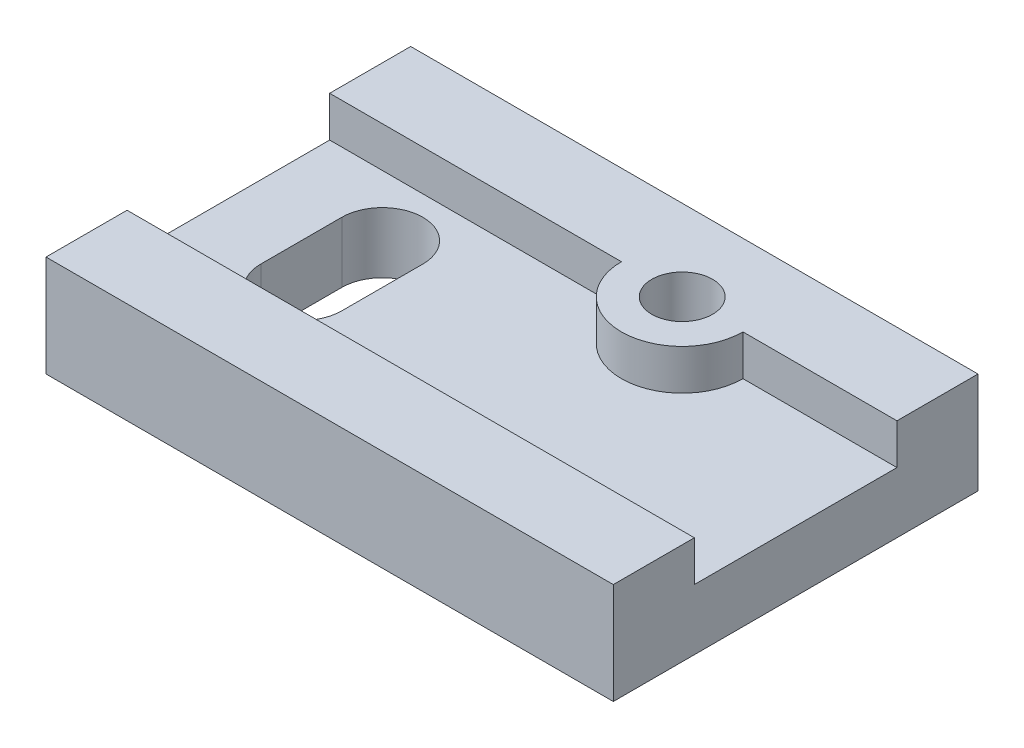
ISO-10303-21;
HEADER;
FILE_DESCRIPTION(('STEP AP214'),'2;1');
FILE_NAME('part.step','',(''),(''),'','','');
FILE_SCHEMA(('AUTOMOTIVE_DESIGN { 1 0 10303 214 1 1 1 1 }'));
ENDSEC;
DATA;
#1=APPLICATION_CONTEXT('core data for automotive mechanical design processes');
#2=APPLICATION_PROTOCOL_DEFINITION('international standard','automotive_design',2000,#1);
#3=PRODUCT_CONTEXT('',#1,'mechanical');
#4=PRODUCT('Part','Part','',(#3));
#5=PRODUCT_RELATED_PRODUCT_CATEGORY('part','',(#4));
#6=PRODUCT_DEFINITION_FORMATION('','',#4);
#7=PRODUCT_DEFINITION_CONTEXT('part definition',#1,'design');
#8=PRODUCT_DEFINITION('design','',#6,#7);
#9=PRODUCT_DEFINITION_SHAPE('','',#8);
#10=(LENGTH_UNIT() NAMED_UNIT(*) SI_UNIT(.MILLI.,.METRE.));
#11=(NAMED_UNIT(*) PLANE_ANGLE_UNIT() SI_UNIT($,.RADIAN.));
#12=(NAMED_UNIT(*) SI_UNIT($,.STERADIAN.) SOLID_ANGLE_UNIT());
#13=UNCERTAINTY_MEASURE_WITH_UNIT(LENGTH_MEASURE(1.E-05),#10,'distance_accuracy_value','');
#14=(GEOMETRIC_REPRESENTATION_CONTEXT(3) GLOBAL_UNCERTAINTY_ASSIGNED_CONTEXT((#13)) GLOBAL_UNIT_ASSIGNED_CONTEXT((#10,
#11,#12)) REPRESENTATION_CONTEXT('',''));
#15=CARTESIAN_POINT('',(0.,0.,0.));
#16=DIRECTION('',(0.,0.,1.));
#17=DIRECTION('',(1.,0.,0.));
#18=AXIS2_PLACEMENT_3D('',#15,#16,#17);
#19=CARTESIAN_POINT('',(0.,25.,0.));
#20=DIRECTION('',(0.,-1.,0.));
#21=DIRECTION('',(0.,0.,-1.));
#22=AXIS2_PLACEMENT_3D('',#19,#20,#21);
#23=PLANE('',#22);
#24=CARTESIAN_POINT('',(-53.,25.,20.));
#25=DIRECTION('',(0.,1.,0.));
#26=DIRECTION('',(0.,0.,1.));
#27=AXIS2_PLACEMENT_3D('',#24,#25,#26);
#28=CIRCLE('',#27,7.5);
#29=CARTESIAN_POINT('',(-53.,25.,27.5));
#30=VERTEX_POINT('',#29);
#31=EDGE_CURVE('E165',#30,#30,#28,.T.);
#32=ORIENTED_EDGE('',*,*,#31,.F.);
#33=EDGE_LOOP('',(#32));
#34=FACE_BOUND('',#33,.T.);
#35=DIRECTION('',(0.,0.,1.));
#36=VECTOR('',#35,1.);
#37=CARTESIAN_POINT('',(-140.,25.,0.));
#38=LINE('',#37,#36);
#39=CARTESIAN_POINT('',(-140.,25.,0.));
#40=VERTEX_POINT('',#39);
#41=CARTESIAN_POINT('',(-140.,25.,20.));
#42=VERTEX_POINT('',#41);
#43=EDGE_CURVE('E224',#40,#42,#38,.T.);
#44=ORIENTED_EDGE('',*,*,#43,.T.);
#45=DIRECTION('',(-1.,0.,0.));
#46=VECTOR('',#45,1.);
#47=CARTESIAN_POINT('',(-140.,25.,20.));
#48=LINE('',#47,#46);
#49=CARTESIAN_POINT('',(-68.,25.,20.));
#50=VERTEX_POINT('',#49);
#51=EDGE_CURVE('E179',#50,#42,#48,.T.);
#52=ORIENTED_EDGE('',*,*,#51,.F.);
#53=CARTESIAN_POINT('',(-53.,25.,20.));
#54=DIRECTION('',(0.,-1.,0.));
#55=DIRECTION('',(0.,0.,1.));
#56=AXIS2_PLACEMENT_3D('',#53,#54,#55);
#57=CIRCLE('',#56,15.);
#58=CARTESIAN_POINT('',(-38.,25.,20.));
#59=VERTEX_POINT('',#58);
#60=EDGE_CURVE('E199',#59,#50,#57,.T.);
#61=ORIENTED_EDGE('',*,*,#60,.F.);
#62=DIRECTION('',(-1.,0.,0.));
#63=VECTOR('',#62,1.);
#64=CARTESIAN_POINT('',(-38.,25.,20.));
#65=LINE('',#64,#63);
#66=CARTESIAN_POINT('',(0.,25.,20.));
#67=VERTEX_POINT('',#66);
#68=EDGE_CURVE('E196',#67,#59,#65,.T.);
#69=ORIENTED_EDGE('',*,*,#68,.F.);
#70=DIRECTION('',(0.,0.,-1.));
#71=VECTOR('',#70,1.);
#72=CARTESIAN_POINT('',(0.,25.,0.));
#73=LINE('',#72,#71);
#74=CARTESIAN_POINT('',(0.,25.,0.));
#75=VERTEX_POINT('',#74);
#76=EDGE_CURVE('E221',#67,#75,#73,.T.);
#77=ORIENTED_EDGE('',*,*,#76,.T.);
#78=DIRECTION('',(-1.,0.,0.));
#79=VECTOR('',#78,1.);
#80=CARTESIAN_POINT('',(0.,25.,0.));
#81=LINE('',#80,#79);
#82=EDGE_CURVE('E220',#75,#40,#81,.T.);
#83=ORIENTED_EDGE('',*,*,#82,.T.);
#84=EDGE_LOOP('',(#44,#52,#61,#69,#77,#83));
#85=FACE_BOUND('',#84,.T.);
#86=ADVANCED_FACE('F31',(#34,#85),#23,.F.);
#87=CARTESIAN_POINT('',(0.,25.,0.));
#88=DIRECTION('',(-1.,0.,0.));
#89=DIRECTION('',(0.,0.,1.));
#90=AXIS2_PLACEMENT_3D('',#87,#88,#89);
#91=PLANE('',#90);
#92=ORIENTED_EDGE('',*,*,#76,.F.);
#93=DIRECTION('',(0.,1.,0.));
#94=VECTOR('',#93,1.);
#95=CARTESIAN_POINT('',(0.,15.,20.));
#96=LINE('',#95,#94);
#97=CARTESIAN_POINT('',(0.,15.,20.));
#98=VERTEX_POINT('',#97);
#99=EDGE_CURVE('E211',#98,#67,#96,.T.);
#100=ORIENTED_EDGE('',*,*,#99,.F.);
#101=DIRECTION('',(0.,0.,-1.));
#102=VECTOR('',#101,1.);
#103=CARTESIAN_POINT('',(0.,15.,20.));
#104=LINE('',#103,#102);
#105=CARTESIAN_POINT('',(0.,15.,70.));
#106=VERTEX_POINT('',#105);
#107=EDGE_CURVE('E182',#106,#98,#104,.T.);
#108=ORIENTED_EDGE('',*,*,#107,.F.);
#109=DIRECTION('',(0.,1.,0.));
#110=VECTOR('',#109,1.);
#111=CARTESIAN_POINT('',(0.,15.,70.));
#112=LINE('',#111,#110);
#113=CARTESIAN_POINT('',(0.,25.,70.));
#114=VERTEX_POINT('',#113);
#115=EDGE_CURVE('E213',#106,#114,#112,.T.);
#116=ORIENTED_EDGE('',*,*,#115,.T.);
#117=CARTESIAN_POINT('',(0.,25.,90.));
#118=VERTEX_POINT('',#117);
#119=EDGE_CURVE('E217',#118,#114,#73,.T.);
#120=ORIENTED_EDGE('',*,*,#119,.F.);
#121=DIRECTION('',(0.,-1.,0.));
#122=VECTOR('',#121,1.);
#123=CARTESIAN_POINT('',(0.,25.,90.));
#124=LINE('',#123,#122);
#125=CARTESIAN_POINT('',(0.,0.,90.));
#126=VERTEX_POINT('',#125);
#127=EDGE_CURVE('E229',#118,#126,#124,.T.);
#128=ORIENTED_EDGE('',*,*,#127,.T.);
#129=DIRECTION('',(0.,0.,-1.));
#130=VECTOR('',#129,1.);
#131=CARTESIAN_POINT('',(0.,0.,0.));
#132=LINE('',#131,#130);
#133=CARTESIAN_POINT('',(0.,0.,0.));
#134=VERTEX_POINT('',#133);
#135=EDGE_CURVE('E206',#126,#134,#132,.T.);
#136=ORIENTED_EDGE('',*,*,#135,.T.);
#137=DIRECTION('',(0.,-1.,0.));
#138=VECTOR('',#137,1.);
#139=CARTESIAN_POINT('',(0.,25.,0.));
#140=LINE('',#139,#138);
#141=EDGE_CURVE('E11',#75,#134,#140,.T.);
#142=ORIENTED_EDGE('',*,*,#141,.F.);
#143=EDGE_LOOP('',(#92,#100,#108,#116,#120,#128,#136,#142));
#144=FACE_BOUND('',#143,.T.);
#145=ADVANCED_FACE('F33',(#144),#91,.F.);
#146=CARTESIAN_POINT('',(0.,25.,0.));
#147=DIRECTION('',(0.,0.,1.));
#148=DIRECTION('',(1.,0.,0.));
#149=AXIS2_PLACEMENT_3D('',#146,#147,#148);
#150=PLANE('',#149);
#151=DIRECTION('',(-1.,0.,0.));
#152=VECTOR('',#151,1.);
#153=CARTESIAN_POINT('',(0.,0.,0.));
#154=LINE('',#153,#152);
#155=CARTESIAN_POINT('',(-140.,0.,0.));
#156=VERTEX_POINT('',#155);
#157=EDGE_CURVE('E232',#134,#156,#154,.T.);
#158=ORIENTED_EDGE('',*,*,#157,.T.);
#159=DIRECTION('',(0.,-1.,0.));
#160=VECTOR('',#159,1.);
#161=CARTESIAN_POINT('',(-140.,25.,0.));
#162=LINE('',#161,#160);
#163=EDGE_CURVE('E39',#40,#156,#162,.T.);
#164=ORIENTED_EDGE('',*,*,#163,.F.);
#165=ORIENTED_EDGE('',*,*,#82,.F.);
#166=ORIENTED_EDGE('',*,*,#141,.T.);
#167=EDGE_LOOP('',(#158,#164,#165,#166));
#168=FACE_BOUND('',#167,.T.);
#169=ADVANCED_FACE('F281',(#168),#150,.F.);
#170=CARTESIAN_POINT('',(-140.,25.,0.));
#171=DIRECTION('',(1.,0.,0.));
#172=DIRECTION('',(0.,0.,-1.));
#173=AXIS2_PLACEMENT_3D('',#170,#171,#172);
#174=PLANE('',#173);
#175=DIRECTION('',(0.,0.,1.));
#176=VECTOR('',#175,1.);
#177=CARTESIAN_POINT('',(-140.,15.,70.));
#178=LINE('',#177,#176);
#179=CARTESIAN_POINT('',(-140.,15.,20.));
#180=VERTEX_POINT('',#179);
#181=CARTESIAN_POINT('',(-140.,15.,70.));
#182=VERTEX_POINT('',#181);
#183=EDGE_CURVE('E175',#180,#182,#178,.T.);
#184=ORIENTED_EDGE('',*,*,#183,.F.);
#185=DIRECTION('',(0.,1.,0.));
#186=VECTOR('',#185,1.);
#187=CARTESIAN_POINT('',(-140.,15.,20.));
#188=LINE('',#187,#186);
#189=EDGE_CURVE('E203',#180,#42,#188,.T.);
#190=ORIENTED_EDGE('',*,*,#189,.T.);
#191=ORIENTED_EDGE('',*,*,#43,.F.);
#192=ORIENTED_EDGE('',*,*,#163,.T.);
#193=DIRECTION('',(0.,0.,1.));
#194=VECTOR('',#193,1.);
#195=CARTESIAN_POINT('',(-140.,0.,0.));
#196=LINE('',#195,#194);
#197=CARTESIAN_POINT('',(-140.,0.,90.));
#198=VERTEX_POINT('',#197);
#199=EDGE_CURVE('E234',#156,#198,#196,.T.);
#200=ORIENTED_EDGE('',*,*,#199,.T.);
#201=DIRECTION('',(0.,-1.,0.));
#202=VECTOR('',#201,1.);
#203=CARTESIAN_POINT('',(-140.,25.,90.));
#204=LINE('',#203,#202);
#205=CARTESIAN_POINT('',(-140.,25.,90.));
#206=VERTEX_POINT('',#205);
#207=EDGE_CURVE('E240',#206,#198,#204,.T.);
#208=ORIENTED_EDGE('',*,*,#207,.F.);
#209=CARTESIAN_POINT('',(-140.,25.,70.));
#210=VERTEX_POINT('',#209);
#211=EDGE_CURVE('E223',#210,#206,#38,.T.);
#212=ORIENTED_EDGE('',*,*,#211,.F.);
#213=DIRECTION('',(0.,1.,0.));
#214=VECTOR('',#213,1.);
#215=CARTESIAN_POINT('',(-140.,15.,70.));
#216=LINE('',#215,#214);
#217=EDGE_CURVE('E194',#182,#210,#216,.T.);
#218=ORIENTED_EDGE('',*,*,#217,.F.);
#219=EDGE_LOOP('',(#184,#190,#191,#192,#200,#208,#212,#218));
#220=FACE_BOUND('',#219,.T.);
#221=ADVANCED_FACE('F248',(#220),#174,.F.);
#222=CARTESIAN_POINT('',(0.,25.,90.));
#223=DIRECTION('',(0.,0.,-1.));
#224=DIRECTION('',(-1.,0.,0.));
#225=AXIS2_PLACEMENT_3D('',#222,#223,#224);
#226=PLANE('',#225);
#227=DIRECTION('',(1.,0.,0.));
#228=VECTOR('',#227,1.);
#229=CARTESIAN_POINT('',(0.,0.,90.));
#230=LINE('',#229,#228);
#231=EDGE_CURVE('E236',#198,#126,#230,.T.);
#232=ORIENTED_EDGE('',*,*,#231,.T.);
#233=ORIENTED_EDGE('',*,*,#127,.F.);
#234=DIRECTION('',(1.,0.,0.));
#235=VECTOR('',#234,1.);
#236=CARTESIAN_POINT('',(0.,25.,90.));
#237=LINE('',#236,#235);
#238=EDGE_CURVE('E227',#206,#118,#237,.T.);
#239=ORIENTED_EDGE('',*,*,#238,.F.);
#240=ORIENTED_EDGE('',*,*,#207,.T.);
#241=EDGE_LOOP('',(#232,#233,#239,#240));
#242=FACE_BOUND('',#241,.T.);
#243=ADVANCED_FACE('F257',(#242),#226,.F.);
#244=ORIENTED_EDGE('',*,*,#119,.T.);
#245=DIRECTION('',(1.,0.,0.));
#246=VECTOR('',#245,1.);
#247=CARTESIAN_POINT('',(0.,25.,70.));
#248=LINE('',#247,#246);
#249=EDGE_CURVE('E172',#210,#114,#248,.T.);
#250=ORIENTED_EDGE('',*,*,#249,.F.);
#251=ORIENTED_EDGE('',*,*,#211,.T.);
#252=ORIENTED_EDGE('',*,*,#238,.T.);
#253=EDGE_LOOP('',(#244,#250,#251,#252));
#254=FACE_BOUND('',#253,.T.);
#255=ADVANCED_FACE('F266',(#254),#23,.F.);
#256=CARTESIAN_POINT('',(0.,0.,0.));
#257=DIRECTION('',(0.,-1.,0.));
#258=DIRECTION('',(0.,0.,-1.));
#259=AXIS2_PLACEMENT_3D('',#256,#257,#258);
#260=PLANE('',#259);
#261=CARTESIAN_POINT('',(-112.,0.,35.));
#262=DIRECTION('',(0.,1.,0.));
#263=DIRECTION('',(0.,0.,1.));
#264=AXIS2_PLACEMENT_3D('',#261,#262,#263);
#265=CIRCLE('',#264,10.);
#266=CARTESIAN_POINT('',(-102.,0.,35.));
#267=VERTEX_POINT('',#266);
#268=CARTESIAN_POINT('',(-122.,0.,35.));
#269=VERTEX_POINT('',#268);
#270=EDGE_CURVE('E134',#267,#269,#265,.T.);
#271=ORIENTED_EDGE('',*,*,#270,.T.);
#272=DIRECTION('',(0.,0.,1.));
#273=VECTOR('',#272,1.);
#274=CARTESIAN_POINT('',(-122.,0.,35.));
#275=LINE('',#274,#273);
#276=CARTESIAN_POINT('',(-122.,0.,55.));
#277=VERTEX_POINT('',#276);
#278=EDGE_CURVE('E143',#269,#277,#275,.T.);
#279=ORIENTED_EDGE('',*,*,#278,.T.);
#280=CARTESIAN_POINT('',(-112.,0.,55.));
#281=DIRECTION('',(0.,1.,0.));
#282=DIRECTION('',(0.,0.,1.));
#283=AXIS2_PLACEMENT_3D('',#280,#281,#282);
#284=CIRCLE('',#283,10.);
#285=CARTESIAN_POINT('',(-102.,0.,55.));
#286=VERTEX_POINT('',#285);
#287=EDGE_CURVE('E46',#277,#286,#284,.T.);
#288=ORIENTED_EDGE('',*,*,#287,.T.);
#289=DIRECTION('',(0.,0.,-1.));
#290=VECTOR('',#289,1.);
#291=CARTESIAN_POINT('',(-102.,0.,55.));
#292=LINE('',#291,#290);
#293=EDGE_CURVE('E140',#286,#267,#292,.T.);
#294=ORIENTED_EDGE('',*,*,#293,.T.);
#295=EDGE_LOOP('',(#271,#279,#288,#294));
#296=FACE_BOUND('',#295,.T.);
#297=CARTESIAN_POINT('',(-53.,0.,20.));
#298=DIRECTION('',(0.,1.,0.));
#299=DIRECTION('',(0.,0.,1.));
#300=AXIS2_PLACEMENT_3D('',#297,#298,#299);
#301=CIRCLE('',#300,7.5);
#302=CARTESIAN_POINT('',(-53.,0.,27.5));
#303=VERTEX_POINT('',#302);
#304=EDGE_CURVE('E169',#303,#303,#301,.T.);
#305=ORIENTED_EDGE('',*,*,#304,.T.);
#306=EDGE_LOOP('',(#305));
#307=FACE_BOUND('',#306,.T.);
#308=ORIENTED_EDGE('',*,*,#135,.F.);
#309=ORIENTED_EDGE('',*,*,#231,.F.);
#310=ORIENTED_EDGE('',*,*,#199,.F.);
#311=ORIENTED_EDGE('',*,*,#157,.F.);
#312=EDGE_LOOP('',(#308,#309,#310,#311));
#313=FACE_BOUND('',#312,.T.);
#314=ADVANCED_FACE('F147',(#296,#307,#313),#260,.T.);
#315=CARTESIAN_POINT('',(-140.,15.,20.));
#316=DIRECTION('',(0.,0.,-1.));
#317=DIRECTION('',(-1.,0.,0.));
#318=AXIS2_PLACEMENT_3D('',#315,#316,#317);
#319=PLANE('',#318);
#320=ORIENTED_EDGE('',*,*,#51,.T.);
#321=ORIENTED_EDGE('',*,*,#189,.F.);
#322=DIRECTION('',(-1.,0.,0.));
#323=VECTOR('',#322,1.);
#324=CARTESIAN_POINT('',(-140.,15.,20.));
#325=LINE('',#324,#323);
#326=CARTESIAN_POINT('',(-68.,15.,20.));
#327=VERTEX_POINT('',#326);
#328=EDGE_CURVE('E191',#327,#180,#325,.T.);
#329=ORIENTED_EDGE('',*,*,#328,.F.);
#330=DIRECTION('',(0.,1.,0.));
#331=VECTOR('',#330,1.);
#332=CARTESIAN_POINT('',(-68.,15.,20.));
#333=LINE('',#332,#331);
#334=EDGE_CURVE('E207',#327,#50,#333,.T.);
#335=ORIENTED_EDGE('',*,*,#334,.T.);
#336=EDGE_LOOP('',(#320,#321,#329,#335));
#337=FACE_BOUND('',#336,.T.);
#338=ADVANCED_FACE('F276',(#337),#319,.F.);
#339=CARTESIAN_POINT('',(-53.,15.,20.));
#340=DIRECTION('',(0.,1.,0.));
#341=DIRECTION('',(0.,0.,1.));
#342=AXIS2_PLACEMENT_3D('',#339,#340,#341);
#343=CYLINDRICAL_SURFACE('',#342,15.);
#344=ORIENTED_EDGE('',*,*,#60,.T.);
#345=ORIENTED_EDGE('',*,*,#334,.F.);
#346=CARTESIAN_POINT('',(-53.,15.,20.));
#347=DIRECTION('',(0.,-1.,0.));
#348=DIRECTION('',(0.,0.,1.));
#349=AXIS2_PLACEMENT_3D('',#346,#347,#348);
#350=CIRCLE('',#349,15.);
#351=CARTESIAN_POINT('',(-38.,15.,20.));
#352=VERTEX_POINT('',#351);
#353=EDGE_CURVE('E188',#352,#327,#350,.T.);
#354=ORIENTED_EDGE('',*,*,#353,.F.);
#355=DIRECTION('',(0.,1.,0.));
#356=VECTOR('',#355,1.);
#357=CARTESIAN_POINT('',(-38.,15.,20.));
#358=LINE('',#357,#356);
#359=EDGE_CURVE('E209',#352,#59,#358,.T.);
#360=ORIENTED_EDGE('',*,*,#359,.T.);
#361=EDGE_LOOP('',(#344,#345,#354,#360));
#362=FACE_BOUND('',#361,.T.);
#363=ADVANCED_FACE('F286',(#362),#343,.T.);
#364=CARTESIAN_POINT('',(-38.,15.,20.));
#365=DIRECTION('',(0.,0.,-1.));
#366=DIRECTION('',(-1.,0.,0.));
#367=AXIS2_PLACEMENT_3D('',#364,#365,#366);
#368=PLANE('',#367);
#369=ORIENTED_EDGE('',*,*,#68,.T.);
#370=ORIENTED_EDGE('',*,*,#359,.F.);
#371=DIRECTION('',(-1.,0.,0.));
#372=VECTOR('',#371,1.);
#373=CARTESIAN_POINT('',(-38.,15.,20.));
#374=LINE('',#373,#372);
#375=EDGE_CURVE('E185',#98,#352,#374,.T.);
#376=ORIENTED_EDGE('',*,*,#375,.F.);
#377=ORIENTED_EDGE('',*,*,#99,.T.);
#378=EDGE_LOOP('',(#369,#370,#376,#377));
#379=FACE_BOUND('',#378,.T.);
#380=ADVANCED_FACE('F284',(#379),#368,.F.);
#381=CARTESIAN_POINT('',(0.,15.,70.));
#382=DIRECTION('',(0.,0.,1.));
#383=DIRECTION('',(1.,0.,0.));
#384=AXIS2_PLACEMENT_3D('',#381,#382,#383);
#385=PLANE('',#384);
#386=ORIENTED_EDGE('',*,*,#249,.T.);
#387=ORIENTED_EDGE('',*,*,#115,.F.);
#388=DIRECTION('',(1.,0.,0.));
#389=VECTOR('',#388,1.);
#390=CARTESIAN_POINT('',(0.,15.,70.));
#391=LINE('',#390,#389);
#392=EDGE_CURVE('E178',#182,#106,#391,.T.);
#393=ORIENTED_EDGE('',*,*,#392,.F.);
#394=ORIENTED_EDGE('',*,*,#217,.T.);
#395=EDGE_LOOP('',(#386,#387,#393,#394));
#396=FACE_BOUND('',#395,.T.);
#397=ADVANCED_FACE('F270',(#396),#385,.F.);
#398=CARTESIAN_POINT('',(-53.,15.,20.));
#399=DIRECTION('',(0.,1.,0.));
#400=DIRECTION('',(0.,0.,1.));
#401=AXIS2_PLACEMENT_3D('',#398,#399,#400);
#402=PLANE('',#401);
#403=CARTESIAN_POINT('',(-112.,15.,35.));
#404=DIRECTION('',(0.,1.,0.));
#405=DIRECTION('',(0.,0.,1.));
#406=AXIS2_PLACEMENT_3D('',#403,#404,#405);
#407=CIRCLE('',#406,10.);
#408=CARTESIAN_POINT('',(-102.,15.,35.));
#409=VERTEX_POINT('',#408);
#410=CARTESIAN_POINT('',(-122.,15.,35.));
#411=VERTEX_POINT('',#410);
#412=EDGE_CURVE('E54',#409,#411,#407,.T.);
#413=ORIENTED_EDGE('',*,*,#412,.F.);
#414=DIRECTION('',(0.,0.,-1.));
#415=VECTOR('',#414,1.);
#416=CARTESIAN_POINT('',(-102.,15.,55.));
#417=LINE('',#416,#415);
#418=CARTESIAN_POINT('',(-102.,15.,55.));
#419=VERTEX_POINT('',#418);
#420=EDGE_CURVE('E150',#419,#409,#417,.T.);
#421=ORIENTED_EDGE('',*,*,#420,.F.);
#422=CARTESIAN_POINT('',(-112.,15.,55.));
#423=DIRECTION('',(0.,1.,0.));
#424=DIRECTION('',(0.,0.,1.));
#425=AXIS2_PLACEMENT_3D('',#422,#423,#424);
#426=CIRCLE('',#425,10.);
#427=CARTESIAN_POINT('',(-122.,15.,55.));
#428=VERTEX_POINT('',#427);
#429=EDGE_CURVE('E153',#428,#419,#426,.T.);
#430=ORIENTED_EDGE('',*,*,#429,.F.);
#431=DIRECTION('',(0.,0.,1.));
#432=VECTOR('',#431,1.);
#433=CARTESIAN_POINT('',(-122.,15.,35.));
#434=LINE('',#433,#432);
#435=EDGE_CURVE('E159',#411,#428,#434,.T.);
#436=ORIENTED_EDGE('',*,*,#435,.F.);
#437=EDGE_LOOP('',(#413,#421,#430,#436));
#438=FACE_BOUND('',#437,.T.);
#439=ORIENTED_EDGE('',*,*,#183,.T.);
#440=ORIENTED_EDGE('',*,*,#392,.T.);
#441=ORIENTED_EDGE('',*,*,#107,.T.);
#442=ORIENTED_EDGE('',*,*,#375,.T.);
#443=ORIENTED_EDGE('',*,*,#353,.T.);
#444=ORIENTED_EDGE('',*,*,#328,.T.);
#445=EDGE_LOOP('',(#439,#440,#441,#442,#443,#444));
#446=FACE_BOUND('',#445,.T.);
#447=ADVANCED_FACE('F272',(#438,#446),#402,.T.);
#448=CARTESIAN_POINT('',(-53.,0.,20.));
#449=DIRECTION('',(0.,1.,0.));
#450=DIRECTION('',(0.,0.,1.));
#451=AXIS2_PLACEMENT_3D('',#448,#449,#450);
#452=CYLINDRICAL_SURFACE('',#451,7.5);
#453=ORIENTED_EDGE('',*,*,#304,.F.);
#454=EDGE_LOOP('',(#453));
#455=FACE_BOUND('',#454,.T.);
#456=ORIENTED_EDGE('',*,*,#31,.T.);
#457=EDGE_LOOP('',(#456));
#458=FACE_BOUND('',#457,.T.);
#459=ADVANCED_FACE('F365',(#455,#458),#452,.F.);
#460=CARTESIAN_POINT('',(-112.,0.,35.));
#461=DIRECTION('',(0.,1.,0.));
#462=DIRECTION('',(0.,0.,1.));
#463=AXIS2_PLACEMENT_3D('',#460,#461,#462);
#464=CYLINDRICAL_SURFACE('',#463,10.);
#465=ORIENTED_EDGE('',*,*,#412,.T.);
#466=DIRECTION('',(0.,1.,0.));
#467=VECTOR('',#466,1.);
#468=CARTESIAN_POINT('',(-122.,0.,35.));
#469=LINE('',#468,#467);
#470=EDGE_CURVE('E130',#269,#411,#469,.T.);
#471=ORIENTED_EDGE('',*,*,#470,.F.);
#472=ORIENTED_EDGE('',*,*,#270,.F.);
#473=DIRECTION('',(0.,1.,0.));
#474=VECTOR('',#473,1.);
#475=CARTESIAN_POINT('',(-102.,0.,35.));
#476=LINE('',#475,#474);
#477=EDGE_CURVE('E163',#267,#409,#476,.T.);
#478=ORIENTED_EDGE('',*,*,#477,.T.);
#479=EDGE_LOOP('',(#465,#471,#472,#478));
#480=FACE_BOUND('',#479,.T.);
#481=ADVANCED_FACE('F132',(#480),#464,.F.);
#482=CARTESIAN_POINT('',(-102.,0.,55.));
#483=DIRECTION('',(1.,0.,0.));
#484=DIRECTION('',(0.,0.,-1.));
#485=AXIS2_PLACEMENT_3D('',#482,#483,#484);
#486=PLANE('',#485);
#487=ORIENTED_EDGE('',*,*,#420,.T.);
#488=ORIENTED_EDGE('',*,*,#477,.F.);
#489=ORIENTED_EDGE('',*,*,#293,.F.);
#490=DIRECTION('',(0.,1.,0.));
#491=VECTOR('',#490,1.);
#492=CARTESIAN_POINT('',(-102.,0.,55.));
#493=LINE('',#492,#491);
#494=EDGE_CURVE('E166',#286,#419,#493,.T.);
#495=ORIENTED_EDGE('',*,*,#494,.T.);
#496=EDGE_LOOP('',(#487,#488,#489,#495));
#497=FACE_BOUND('',#496,.T.);
#498=ADVANCED_FACE('F391',(#497),#486,.F.);
#499=CARTESIAN_POINT('',(-112.,0.,55.));
#500=DIRECTION('',(0.,1.,0.));
#501=DIRECTION('',(0.,0.,1.));
#502=AXIS2_PLACEMENT_3D('',#499,#500,#501);
#503=CYLINDRICAL_SURFACE('',#502,10.);
#504=ORIENTED_EDGE('',*,*,#429,.T.);
#505=ORIENTED_EDGE('',*,*,#494,.F.);
#506=ORIENTED_EDGE('',*,*,#287,.F.);
#507=DIRECTION('',(0.,1.,0.));
#508=VECTOR('',#507,1.);
#509=CARTESIAN_POINT('',(-122.,0.,55.));
#510=LINE('',#509,#508);
#511=EDGE_CURVE('E139',#277,#428,#510,.T.);
#512=ORIENTED_EDGE('',*,*,#511,.T.);
#513=EDGE_LOOP('',(#504,#505,#506,#512));
#514=FACE_BOUND('',#513,.T.);
#515=ADVANCED_FACE('F400',(#514),#503,.F.);
#516=CARTESIAN_POINT('',(-122.,0.,35.));
#517=DIRECTION('',(-1.,0.,0.));
#518=DIRECTION('',(0.,0.,1.));
#519=AXIS2_PLACEMENT_3D('',#516,#517,#518);
#520=PLANE('',#519);
#521=ORIENTED_EDGE('',*,*,#435,.T.);
#522=ORIENTED_EDGE('',*,*,#511,.F.);
#523=ORIENTED_EDGE('',*,*,#278,.F.);
#524=ORIENTED_EDGE('',*,*,#470,.T.);
#525=EDGE_LOOP('',(#521,#522,#523,#524));
#526=FACE_BOUND('',#525,.T.);
#527=ADVANCED_FACE('F144',(#526),#520,.F.);
#528=CLOSED_SHELL('',(#86,#145,#169,#221,#243,#255,#314,#338,#363,#380,#397,#447,#459,#481,#498,
#515,#527));
#529=MANIFOLD_SOLID_BREP('B2',#528);
#530=ADVANCED_BREP_SHAPE_REPRESENTATION('',(#18,#529),#14);
#531=SHAPE_DEFINITION_REPRESENTATION(#9,#530);
ENDSEC;
END-ISO-10303-21;
